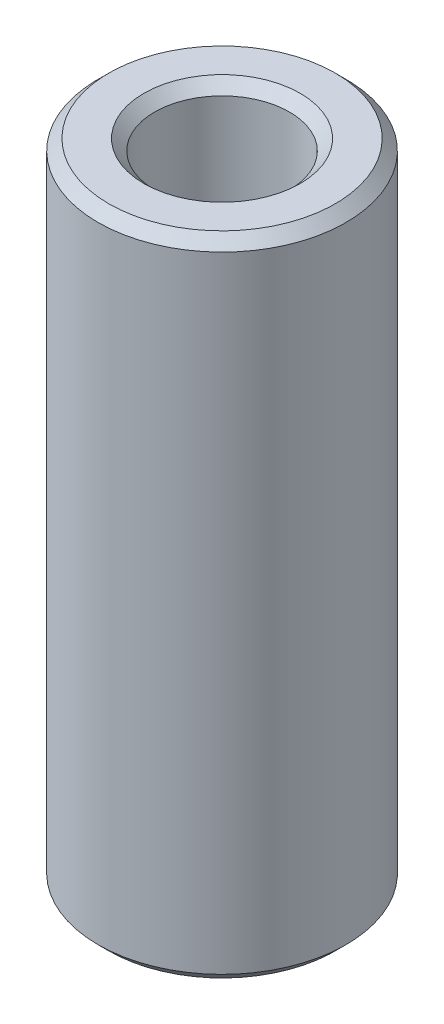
from build123d import *

# Parameters (mm, degrees)
ESQUISSE1_R      = 23
ESQUISSE1_R_2    = 12.5
EXTRUSION1_DEPTH = 120
CHANFREIN1_SIZE  = 2


with BuildPart() as part:
    # Esquisse1 → Extrusion1 (new body)
    with BuildSketch(Plane(origin=(0, 0, 0), x_dir=(1, 0, 0), z_dir=(0, 1, 0))):
        with Locations(Location((0, 0, 0), (0, 0, 270))):
            Circle(ESQUISSE1_R)
        with Locations(Location((0, 0, 0), (0, 0, 270))):
            Circle(ESQUISSE1_R_2, mode=Mode.SUBTRACT)
    extrude(amount=EXTRUSION1_DEPTH)

    # Chanfrein1
    chanfrein1_edges = [part.edges().sort_by_distance(p)[0] for p in [
        (0, 0, -23),
        (0, 120, -23),
        (0, 0, -12.5),
        (0, 120, -12.5),
    ]]
    chamfer(chanfrein1_edges, length=CHANFREIN1_SIZE)


solid = part.part
